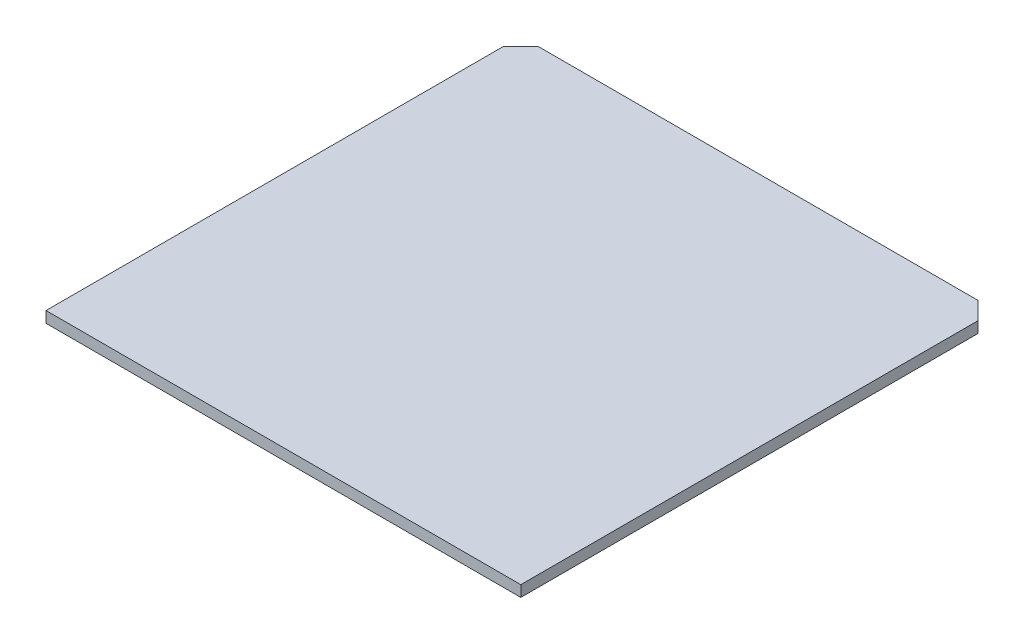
ISO-10303-21;
HEADER;
FILE_DESCRIPTION(('STEP AP214'),'2;1');
FILE_NAME('part.step','',(''),(''),'','','');
FILE_SCHEMA(('AUTOMOTIVE_DESIGN { 1 0 10303 214 1 1 1 1 }'));
ENDSEC;
DATA;
#1=APPLICATION_CONTEXT('core data for automotive mechanical design processes');
#2=APPLICATION_PROTOCOL_DEFINITION('international standard','automotive_design',2000,#1);
#3=PRODUCT_CONTEXT('',#1,'mechanical');
#4=PRODUCT('Part','Part','',(#3));
#5=PRODUCT_RELATED_PRODUCT_CATEGORY('part','',(#4));
#6=PRODUCT_DEFINITION_FORMATION('','',#4);
#7=PRODUCT_DEFINITION_CONTEXT('part definition',#1,'design');
#8=PRODUCT_DEFINITION('design','',#6,#7);
#9=PRODUCT_DEFINITION_SHAPE('','',#8);
#10=(LENGTH_UNIT() NAMED_UNIT(*) SI_UNIT(.MILLI.,.METRE.));
#11=(NAMED_UNIT(*) PLANE_ANGLE_UNIT() SI_UNIT($,.RADIAN.));
#12=(NAMED_UNIT(*) SI_UNIT($,.STERADIAN.) SOLID_ANGLE_UNIT());
#13=UNCERTAINTY_MEASURE_WITH_UNIT(LENGTH_MEASURE(1.E-05),#10,'distance_accuracy_value','');
#14=(GEOMETRIC_REPRESENTATION_CONTEXT(3) GLOBAL_UNCERTAINTY_ASSIGNED_CONTEXT((#13)) GLOBAL_UNIT_ASSIGNED_CONTEXT((#10,
#11,#12)) REPRESENTATION_CONTEXT('',''));
#15=CARTESIAN_POINT('',(0.,0.,0.));
#16=DIRECTION('',(0.,0.,1.));
#17=DIRECTION('',(1.,0.,0.));
#18=AXIS2_PLACEMENT_3D('',#15,#16,#17);
#19=CARTESIAN_POINT('',(34.29,1.6,-34.29));
#20=DIRECTION('',(-1.,0.,0.));
#21=DIRECTION('',(0.,0.,1.));
#22=AXIS2_PLACEMENT_3D('',#19,#20,#21);
#23=PLANE('',#22);
#24=DIRECTION('',(0.,0.,-1.));
#25=VECTOR('',#24,1.);
#26=CARTESIAN_POINT('',(34.29,0.,-34.29));
#27=LINE('',#26,#25);
#28=CARTESIAN_POINT('',(34.29,0.,34.29));
#29=VERTEX_POINT('',#28);
#30=CARTESIAN_POINT('',(34.29,0.,-31.75));
#31=VERTEX_POINT('',#30);
#32=EDGE_CURVE('E110',#29,#31,#27,.T.);
#33=ORIENTED_EDGE('',*,*,#32,.T.);
#34=DIRECTION('',(0.,1.,0.));
#35=VECTOR('',#34,1.);
#36=CARTESIAN_POINT('',(34.29,1.6,-31.75));
#37=LINE('',#36,#35);
#38=CARTESIAN_POINT('',(34.29,1.6,-31.75));
#39=VERTEX_POINT('',#38);
#40=EDGE_CURVE('E54',#31,#39,#37,.T.);
#41=ORIENTED_EDGE('',*,*,#40,.T.);
#42=DIRECTION('',(0.,0.,-1.));
#43=VECTOR('',#42,1.);
#44=CARTESIAN_POINT('',(34.29,1.6,-34.29));
#45=LINE('',#44,#43);
#46=CARTESIAN_POINT('',(34.29,1.6,34.29));
#47=VERTEX_POINT('',#46);
#48=EDGE_CURVE('E117',#47,#39,#45,.T.);
#49=ORIENTED_EDGE('',*,*,#48,.F.);
#50=DIRECTION('',(0.,-1.,0.));
#51=VECTOR('',#50,1.);
#52=CARTESIAN_POINT('',(34.29,1.6,34.29));
#53=LINE('',#52,#51);
#54=EDGE_CURVE('E102',#47,#29,#53,.T.);
#55=ORIENTED_EDGE('',*,*,#54,.T.);
#56=EDGE_LOOP('',(#33,#41,#49,#55));
#57=FACE_BOUND('',#56,.T.);
#58=ADVANCED_FACE('F31',(#57),#23,.F.);
#59=CARTESIAN_POINT('',(-34.29,1.6,-34.29));
#60=DIRECTION('',(0.,0.,1.));
#61=DIRECTION('',(1.,0.,0.));
#62=AXIS2_PLACEMENT_3D('',#59,#60,#61);
#63=PLANE('',#62);
#64=DIRECTION('',(-1.,0.,0.));
#65=VECTOR('',#64,1.);
#66=CARTESIAN_POINT('',(-34.29,1.6,-34.29));
#67=LINE('',#66,#65);
#68=CARTESIAN_POINT('',(31.75,1.6,-34.29));
#69=VERTEX_POINT('',#68);
#70=CARTESIAN_POINT('',(-31.75,1.6,-34.29));
#71=VERTEX_POINT('',#70);
#72=EDGE_CURVE('E92',#69,#71,#67,.T.);
#73=ORIENTED_EDGE('',*,*,#72,.F.);
#74=DIRECTION('',(0.,-1.,0.));
#75=VECTOR('',#74,1.);
#76=CARTESIAN_POINT('',(31.75,1.6,-34.29));
#77=LINE('',#76,#75);
#78=CARTESIAN_POINT('',(31.75,0.,-34.29));
#79=VERTEX_POINT('',#78);
#80=EDGE_CURVE('E120',#69,#79,#77,.T.);
#81=ORIENTED_EDGE('',*,*,#80,.T.);
#82=DIRECTION('',(-1.,0.,0.));
#83=VECTOR('',#82,1.);
#84=CARTESIAN_POINT('',(-34.29,0.,-34.29));
#85=LINE('',#84,#83);
#86=CARTESIAN_POINT('',(-31.75,0.,-34.29));
#87=VERTEX_POINT('',#86);
#88=EDGE_CURVE('E112',#79,#87,#85,.T.);
#89=ORIENTED_EDGE('',*,*,#88,.T.);
#90=DIRECTION('',(0.,1.,0.));
#91=VECTOR('',#90,1.);
#92=CARTESIAN_POINT('',(-31.75,1.6,-34.29));
#93=LINE('',#92,#91);
#94=EDGE_CURVE('E101',#87,#71,#93,.T.);
#95=ORIENTED_EDGE('',*,*,#94,.T.);
#96=EDGE_LOOP('',(#73,#81,#89,#95));
#97=FACE_BOUND('',#96,.T.);
#98=ADVANCED_FACE('F133',(#97),#63,.F.);
#99=CARTESIAN_POINT('',(-34.29,1.6,-34.29));
#100=DIRECTION('',(1.,0.,0.));
#101=DIRECTION('',(0.,0.,-1.));
#102=AXIS2_PLACEMENT_3D('',#99,#100,#101);
#103=PLANE('',#102);
#104=DIRECTION('',(0.,0.,1.));
#105=VECTOR('',#104,1.);
#106=CARTESIAN_POINT('',(-34.29,1.6,-34.29));
#107=LINE('',#106,#105);
#108=CARTESIAN_POINT('',(-34.29,1.6,-31.75));
#109=VERTEX_POINT('',#108);
#110=CARTESIAN_POINT('',(-34.29,1.6,34.29));
#111=VERTEX_POINT('',#110);
#112=EDGE_CURVE('E84',#109,#111,#107,.T.);
#113=ORIENTED_EDGE('',*,*,#112,.F.);
#114=DIRECTION('',(0.,-1.,0.));
#115=VECTOR('',#114,1.);
#116=CARTESIAN_POINT('',(-34.29,1.6,-31.75));
#117=LINE('',#116,#115);
#118=CARTESIAN_POINT('',(-34.29,0.,-31.75));
#119=VERTEX_POINT('',#118);
#120=EDGE_CURVE('E11',#109,#119,#117,.T.);
#121=ORIENTED_EDGE('',*,*,#120,.T.);
#122=DIRECTION('',(0.,0.,1.));
#123=VECTOR('',#122,1.);
#124=CARTESIAN_POINT('',(-34.29,0.,-34.29));
#125=LINE('',#124,#123);
#126=CARTESIAN_POINT('',(-34.29,0.,34.29));
#127=VERTEX_POINT('',#126);
#128=EDGE_CURVE('E98',#119,#127,#125,.T.);
#129=ORIENTED_EDGE('',*,*,#128,.T.);
#130=DIRECTION('',(0.,-1.,0.));
#131=VECTOR('',#130,1.);
#132=CARTESIAN_POINT('',(-34.29,1.6,34.29));
#133=LINE('',#132,#131);
#134=EDGE_CURVE('E95',#111,#127,#133,.T.);
#135=ORIENTED_EDGE('',*,*,#134,.F.);
#136=EDGE_LOOP('',(#113,#121,#129,#135));
#137=FACE_BOUND('',#136,.T.);
#138=ADVANCED_FACE('F96',(#137),#103,.F.);
#139=CARTESIAN_POINT('',(-34.29,1.6,34.29));
#140=DIRECTION('',(0.,0.,-1.));
#141=DIRECTION('',(-1.,0.,0.));
#142=AXIS2_PLACEMENT_3D('',#139,#140,#141);
#143=PLANE('',#142);
#144=DIRECTION('',(1.,0.,0.));
#145=VECTOR('',#144,1.);
#146=CARTESIAN_POINT('',(-34.29,0.,34.29));
#147=LINE('',#146,#145);
#148=EDGE_CURVE('E116',#127,#29,#147,.T.);
#149=ORIENTED_EDGE('',*,*,#148,.T.);
#150=ORIENTED_EDGE('',*,*,#54,.F.);
#151=DIRECTION('',(1.,0.,0.));
#152=VECTOR('',#151,1.);
#153=CARTESIAN_POINT('',(-34.29,1.6,34.29));
#154=LINE('',#153,#152);
#155=EDGE_CURVE('E88',#111,#47,#154,.T.);
#156=ORIENTED_EDGE('',*,*,#155,.F.);
#157=ORIENTED_EDGE('',*,*,#134,.T.);
#158=EDGE_LOOP('',(#149,#150,#156,#157));
#159=FACE_BOUND('',#158,.T.);
#160=ADVANCED_FACE('F104',(#159),#143,.F.);
#161=CARTESIAN_POINT('',(34.29,1.6,34.29));
#162=DIRECTION('',(0.,1.,0.));
#163=DIRECTION('',(0.,0.,1.));
#164=AXIS2_PLACEMENT_3D('',#161,#162,#163);
#165=PLANE('',#164);
#166=ORIENTED_EDGE('',*,*,#48,.T.);
#167=DIRECTION('',(0.707106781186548,0.,0.707106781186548));
#168=VECTOR('',#167,1.);
#169=CARTESIAN_POINT('',(67.31,1.6,1.27));
#170=LINE('',#169,#168);
#171=EDGE_CURVE('E39',#39,#69,#170,.F.);
#172=ORIENTED_EDGE('',*,*,#171,.T.);
#173=ORIENTED_EDGE('',*,*,#72,.T.);
#174=DIRECTION('',(0.707106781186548,0.,-0.707106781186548));
#175=VECTOR('',#174,1.);
#176=CARTESIAN_POINT('',(-33.02,1.6,-33.02));
#177=LINE('',#176,#175);
#178=EDGE_CURVE('E46',#71,#109,#177,.F.);
#179=ORIENTED_EDGE('',*,*,#178,.T.);
#180=ORIENTED_EDGE('',*,*,#112,.T.);
#181=ORIENTED_EDGE('',*,*,#155,.T.);
#182=EDGE_LOOP('',(#166,#172,#173,#179,#180,#181));
#183=FACE_BOUND('',#182,.T.);
#184=ADVANCED_FACE('F86',(#183),#165,.T.);
#185=CARTESIAN_POINT('',(34.29,0.,34.29));
#186=DIRECTION('',(0.,1.,0.));
#187=DIRECTION('',(0.,0.,1.));
#188=AXIS2_PLACEMENT_3D('',#185,#186,#187);
#189=PLANE('',#188);
#190=ORIENTED_EDGE('',*,*,#88,.F.);
#191=DIRECTION('',(-0.707106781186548,0.,-0.707106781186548));
#192=VECTOR('',#191,1.);
#193=CARTESIAN_POINT('',(31.75,0.,-34.29));
#194=LINE('',#193,#192);
#195=EDGE_CURVE('E125',#79,#31,#194,.F.);
#196=ORIENTED_EDGE('',*,*,#195,.T.);
#197=ORIENTED_EDGE('',*,*,#32,.F.);
#198=ORIENTED_EDGE('',*,*,#148,.F.);
#199=ORIENTED_EDGE('',*,*,#128,.F.);
#200=DIRECTION('',(-0.707106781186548,0.,0.707106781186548));
#201=VECTOR('',#200,1.);
#202=CARTESIAN_POINT('',(-34.29,0.,-31.75));
#203=LINE('',#202,#201);
#204=EDGE_CURVE('E123',#119,#87,#203,.F.);
#205=ORIENTED_EDGE('',*,*,#204,.T.);
#206=EDGE_LOOP('',(#190,#196,#197,#198,#199,#205));
#207=FACE_BOUND('',#206,.T.);
#208=ADVANCED_FACE('F139',(#207),#189,.F.);
#209=CARTESIAN_POINT('',(31.75,1.6,-34.29));
#210=DIRECTION('',(-0.707106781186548,0.,0.707106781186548));
#211=DIRECTION('',(0.707106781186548,0.,0.707106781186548));
#212=AXIS2_PLACEMENT_3D('',#209,#210,#211);
#213=PLANE('',#212);
#214=ORIENTED_EDGE('',*,*,#171,.F.);
#215=ORIENTED_EDGE('',*,*,#40,.F.);
#216=ORIENTED_EDGE('',*,*,#195,.F.);
#217=ORIENTED_EDGE('',*,*,#80,.F.);
#218=EDGE_LOOP('',(#214,#215,#216,#217));
#219=FACE_BOUND('',#218,.T.);
#220=ADVANCED_FACE('F136',(#219),#213,.F.);
#221=CARTESIAN_POINT('',(-34.29,1.6,-31.75));
#222=DIRECTION('',(0.707106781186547,0.,0.707106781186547));
#223=DIRECTION('',(0.707106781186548,0.,-0.707106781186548));
#224=AXIS2_PLACEMENT_3D('',#221,#222,#223);
#225=PLANE('',#224);
#226=ORIENTED_EDGE('',*,*,#178,.F.);
#227=ORIENTED_EDGE('',*,*,#94,.F.);
#228=ORIENTED_EDGE('',*,*,#204,.F.);
#229=ORIENTED_EDGE('',*,*,#120,.F.);
#230=EDGE_LOOP('',(#226,#227,#228,#229));
#231=FACE_BOUND('',#230,.T.);
#232=ADVANCED_FACE('F33',(#231),#225,.F.);
#233=CLOSED_SHELL('',(#58,#98,#138,#160,#184,#208,#220,#232));
#234=MANIFOLD_SOLID_BREP('B2',#233);
#235=ADVANCED_BREP_SHAPE_REPRESENTATION('',(#18,#234),#14);
#236=SHAPE_DEFINITION_REPRESENTATION(#9,#235);
ENDSEC;
END-ISO-10303-21;
